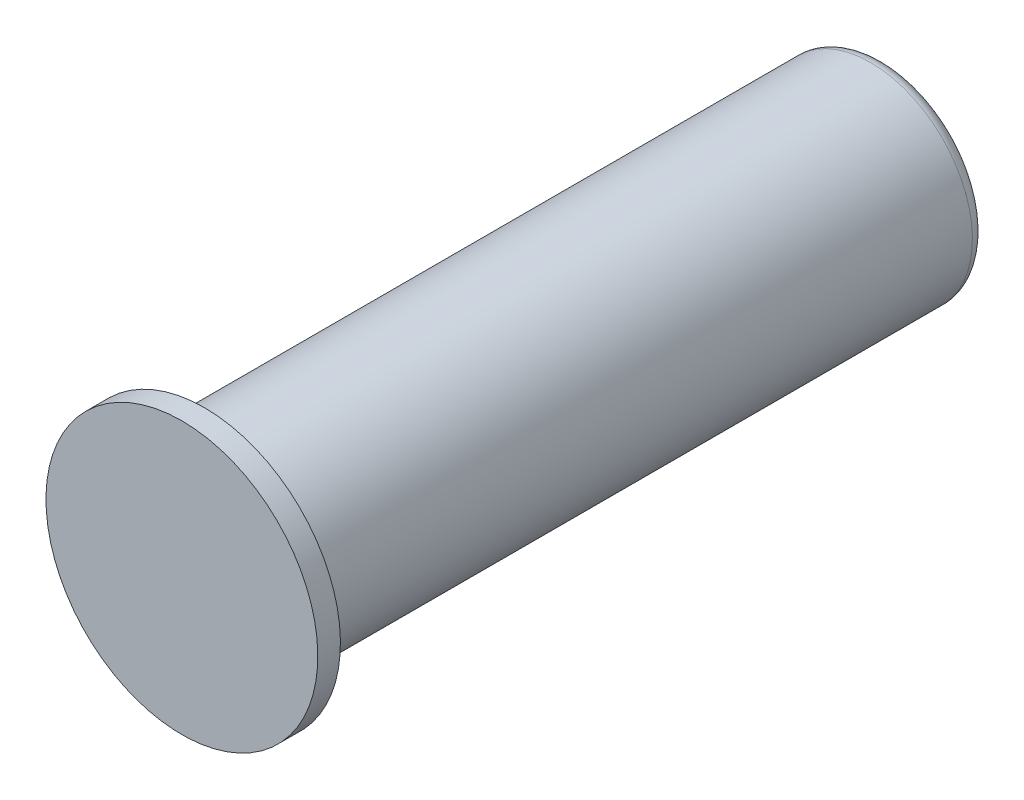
ISO-10303-21;
HEADER;
FILE_DESCRIPTION(('STEP AP214'),'2;1');
FILE_NAME('part.step','',(''),(''),'','','');
FILE_SCHEMA(('AUTOMOTIVE_DESIGN { 1 0 10303 214 1 1 1 1 }'));
ENDSEC;
DATA;
#1=APPLICATION_CONTEXT('core data for automotive mechanical design processes');
#2=APPLICATION_PROTOCOL_DEFINITION('international standard','automotive_design',2000,#1);
#3=PRODUCT_CONTEXT('',#1,'mechanical');
#4=PRODUCT('Part','Part','',(#3));
#5=PRODUCT_RELATED_PRODUCT_CATEGORY('part','',(#4));
#6=PRODUCT_DEFINITION_FORMATION('','',#4);
#7=PRODUCT_DEFINITION_CONTEXT('part definition',#1,'design');
#8=PRODUCT_DEFINITION('design','',#6,#7);
#9=PRODUCT_DEFINITION_SHAPE('','',#8);
#10=(LENGTH_UNIT() NAMED_UNIT(*) SI_UNIT(.MILLI.,.METRE.));
#11=(NAMED_UNIT(*) PLANE_ANGLE_UNIT() SI_UNIT($,.RADIAN.));
#12=(NAMED_UNIT(*) SI_UNIT($,.STERADIAN.) SOLID_ANGLE_UNIT());
#13=UNCERTAINTY_MEASURE_WITH_UNIT(LENGTH_MEASURE(1.E-05),#10,'distance_accuracy_value','');
#14=(GEOMETRIC_REPRESENTATION_CONTEXT(3) GLOBAL_UNCERTAINTY_ASSIGNED_CONTEXT((#13)) GLOBAL_UNIT_ASSIGNED_CONTEXT((#10,
#11,#12)) REPRESENTATION_CONTEXT('',''));
#15=CARTESIAN_POINT('',(0.,0.,0.));
#16=DIRECTION('',(0.,0.,1.));
#17=DIRECTION('',(1.,0.,0.));
#18=AXIS2_PLACEMENT_3D('',#15,#16,#17);
#19=CARTESIAN_POINT('',(0.,0.,0.));
#20=DIRECTION('',(0.,0.,1.));
#21=DIRECTION('',(0.,-1.,0.));
#22=AXIS2_PLACEMENT_3D('',#19,#20,#21);
#23=PLANE('',#22);
#24=CARTESIAN_POINT('',(0.,0.,0.));
#25=DIRECTION('',(0.,0.,-1.));
#26=DIRECTION('',(0.,1.,0.));
#27=AXIS2_PLACEMENT_3D('',#24,#25,#26);
#28=CIRCLE('',#27,30.);
#29=CARTESIAN_POINT('',(0.,30.,0.));
#30=VERTEX_POINT('',#29);
#31=EDGE_CURVE('E11',#30,#30,#28,.T.);
#32=ORIENTED_EDGE('',*,*,#31,.F.);
#33=EDGE_LOOP('',(#32));
#34=FACE_BOUND('',#33,.T.);
#35=ADVANCED_FACE('F36',(#34),#23,.T.);
#36=CARTESIAN_POINT('',(0.,0.,-143.690598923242));
#37=DIRECTION('',(0.,0.,-1.));
#38=DIRECTION('',(0.,1.,0.));
#39=AXIS2_PLACEMENT_3D('',#36,#37,#38);
#40=CYLINDRICAL_SURFACE('',#39,30.);
#41=ORIENTED_EDGE('',*,*,#31,.T.);
#42=EDGE_LOOP('',(#41));
#43=FACE_BOUND('',#42,.T.);
#44=CARTESIAN_POINT('',(0.,0.,-5.));
#45=DIRECTION('',(0.,0.,-1.));
#46=DIRECTION('',(0.,1.,0.));
#47=AXIS2_PLACEMENT_3D('',#44,#45,#46);
#48=CIRCLE('',#47,30.);
#49=CARTESIAN_POINT('',(0.,30.,-5.));
#50=VERTEX_POINT('',#49);
#51=EDGE_CURVE('E43',#50,#50,#48,.T.);
#52=ORIENTED_EDGE('',*,*,#51,.F.);
#53=EDGE_LOOP('',(#52));
#54=FACE_BOUND('',#53,.T.);
#55=ADVANCED_FACE('F58',(#43,#54),#40,.T.);
#56=CARTESIAN_POINT('',(0.,30.,-5.));
#57=DIRECTION('',(0.,0.,-1.));
#58=DIRECTION('',(0.,1.,0.));
#59=AXIS2_PLACEMENT_3D('',#56,#57,#58);
#60=PLANE('',#59);
#61=ORIENTED_EDGE('',*,*,#51,.T.);
#62=EDGE_LOOP('',(#61));
#63=FACE_BOUND('',#62,.T.);
#64=CARTESIAN_POINT('',(0.,0.,-5.));
#65=DIRECTION('',(0.,0.,-1.));
#66=DIRECTION('',(0.,1.,0.));
#67=AXIS2_PLACEMENT_3D('',#64,#65,#66);
#68=CIRCLE('',#67,22.5);
#69=CARTESIAN_POINT('',(0.,22.5,-5.));
#70=VERTEX_POINT('',#69);
#71=EDGE_CURVE('E70',#70,#70,#68,.T.);
#72=ORIENTED_EDGE('',*,*,#71,.F.);
#73=EDGE_LOOP('',(#72));
#74=FACE_BOUND('',#73,.T.);
#75=ADVANCED_FACE('F62',(#63,#74),#60,.T.);
#76=CARTESIAN_POINT('',(0.,0.,-143.690598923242));
#77=DIRECTION('',(0.,0.,-1.));
#78=DIRECTION('',(0.,1.,0.));
#79=AXIS2_PLACEMENT_3D('',#76,#77,#78);
#80=CYLINDRICAL_SURFACE('',#79,22.5);
#81=ORIENTED_EDGE('',*,*,#71,.T.);
#82=EDGE_LOOP('',(#81));
#83=FACE_BOUND('',#82,.T.);
#84=CARTESIAN_POINT('',(0.,0.,-152.));
#85=DIRECTION('',(0.,0.,-1.));
#86=DIRECTION('',(0.,1.,0.));
#87=AXIS2_PLACEMENT_3D('',#84,#85,#86);
#88=CIRCLE('',#87,22.5);
#89=CARTESIAN_POINT('',(0.,22.5,-152.));
#90=VERTEX_POINT('',#89);
#91=EDGE_CURVE('E74',#90,#90,#88,.T.);
#92=ORIENTED_EDGE('',*,*,#91,.F.);
#93=EDGE_LOOP('',(#92));
#94=FACE_BOUND('',#93,.T.);
#95=ADVANCED_FACE('F109',(#83,#94),#80,.T.);
#96=CARTESIAN_POINT('',(0.,0.,-152.));
#97=DIRECTION('',(0.,0.,-1.));
#98=DIRECTION('',(0.,1.,0.));
#99=AXIS2_PLACEMENT_3D('',#96,#97,#98);
#100=TOROIDAL_SURFACE('',#99,19.5,3.);
#101=ORIENTED_EDGE('',*,*,#91,.T.);
#102=EDGE_LOOP('',(#101));
#103=FACE_BOUND('',#102,.T.);
#104=CARTESIAN_POINT('',(0.,0.,-155.));
#105=DIRECTION('',(0.,0.,-1.));
#106=DIRECTION('',(0.,1.,0.));
#107=AXIS2_PLACEMENT_3D('',#104,#105,#106);
#108=CIRCLE('',#107,19.5);
#109=CARTESIAN_POINT('',(0.,19.5,-155.));
#110=VERTEX_POINT('',#109);
#111=EDGE_CURVE('E80',#110,#110,#108,.T.);
#112=ORIENTED_EDGE('',*,*,#111,.F.);
#113=EDGE_LOOP('',(#112));
#114=FACE_BOUND('',#113,.T.);
#115=ADVANCED_FACE('F103',(#103,#114),#100,.T.);
#116=CARTESIAN_POINT('',(0.,19.5,-155.));
#117=DIRECTION('',(0.,0.,-1.));
#118=DIRECTION('',(0.,1.,0.));
#119=AXIS2_PLACEMENT_3D('',#116,#117,#118);
#120=PLANE('',#119);
#121=ORIENTED_EDGE('',*,*,#111,.T.);
#122=EDGE_LOOP('',(#121));
#123=FACE_BOUND('',#122,.T.);
#124=CARTESIAN_POINT('',(0.,0.,-155.));
#125=DIRECTION('',(0.,0.,-1.));
#126=DIRECTION('',(0.,1.,0.));
#127=AXIS2_PLACEMENT_3D('',#124,#125,#126);
#128=CIRCLE('',#127,4.5);
#129=CARTESIAN_POINT('',(0.,4.5,-155.));
#130=VERTEX_POINT('',#129);
#131=EDGE_CURVE('E84',#130,#130,#128,.T.);
#132=ORIENTED_EDGE('',*,*,#131,.F.);
#133=EDGE_LOOP('',(#132));
#134=FACE_BOUND('',#133,.T.);
#135=ADVANCED_FACE('F98',(#123,#134),#120,.T.);
#136=CARTESIAN_POINT('',(0.,0.,-154.5));
#137=DIRECTION('',(0.,0.,-1.));
#138=DIRECTION('',(0.,1.,0.));
#139=AXIS2_PLACEMENT_3D('',#136,#137,#138);
#140=CONICAL_SURFACE('',#139,4.,0.785398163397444);
#141=ORIENTED_EDGE('',*,*,#131,.T.);
#142=EDGE_LOOP('',(#141));
#143=FACE_BOUND('',#142,.T.);
#144=CARTESIAN_POINT('',(0.,0.,-154.5));
#145=DIRECTION('',(0.,0.,-1.));
#146=DIRECTION('',(0.,1.,0.));
#147=AXIS2_PLACEMENT_3D('',#144,#145,#146);
#148=CIRCLE('',#147,4.);
#149=CARTESIAN_POINT('',(0.,4.,-154.5));
#150=VERTEX_POINT('',#149);
#151=EDGE_CURVE('E88',#150,#150,#148,.T.);
#152=ORIENTED_EDGE('',*,*,#151,.F.);
#153=EDGE_LOOP('',(#152));
#154=FACE_BOUND('',#153,.T.);
#155=ADVANCED_FACE('F53',(#143,#154),#140,.F.);
#156=CARTESIAN_POINT('',(0.,0.,-143.690598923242));
#157=DIRECTION('',(0.,0.,-1.));
#158=DIRECTION('',(0.,1.,0.));
#159=AXIS2_PLACEMENT_3D('',#156,#157,#158);
#160=CYLINDRICAL_SURFACE('',#159,4.);
#161=ORIENTED_EDGE('',*,*,#151,.T.);
#162=EDGE_LOOP('',(#161));
#163=FACE_BOUND('',#162,.T.);
#164=CARTESIAN_POINT('',(0.,0.,-146.));
#165=DIRECTION('',(0.,0.,-1.));
#166=DIRECTION('',(0.,1.,0.));
#167=AXIS2_PLACEMENT_3D('',#164,#165,#166);
#168=CIRCLE('',#167,4.);
#169=CARTESIAN_POINT('',(0.,4.,-146.));
#170=VERTEX_POINT('',#169);
#171=EDGE_CURVE('E92',#170,#170,#168,.T.);
#172=ORIENTED_EDGE('',*,*,#171,.F.);
#173=EDGE_LOOP('',(#172));
#174=FACE_BOUND('',#173,.T.);
#175=ADVANCED_FACE('F48',(#163,#174),#160,.F.);
#176=CARTESIAN_POINT('',(0.,0.,-143.690598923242));
#177=DIRECTION('',(0.,0.,-1.));
#178=DIRECTION('',(0.,1.,0.));
#179=AXIS2_PLACEMENT_3D('',#176,#177,#178);
#180=CONICAL_SURFACE('',#179,0.,1.0471975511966);
#181=ORIENTED_EDGE('',*,*,#171,.T.);
#182=EDGE_LOOP('',(#181));
#183=FACE_BOUND('',#182,.T.);
#184=CARTESIAN_POINT('',(0.,0.,-143.690598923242));
#185=VERTEX_POINT('',#184);
#186=VERTEX_LOOP('',#185);
#187=FACE_BOUND('',#186,.T.);
#188=ADVANCED_FACE('F46',(#183,#187),#180,.F.);
#189=CLOSED_SHELL('',(#35,#55,#75,#95,#115,#135,#155,#175,#188));
#190=MANIFOLD_SOLID_BREP('B2',#189);
#191=ADVANCED_BREP_SHAPE_REPRESENTATION('',(#18,#190),#14);
#192=SHAPE_DEFINITION_REPRESENTATION(#9,#191);
ENDSEC;
END-ISO-10303-21;
